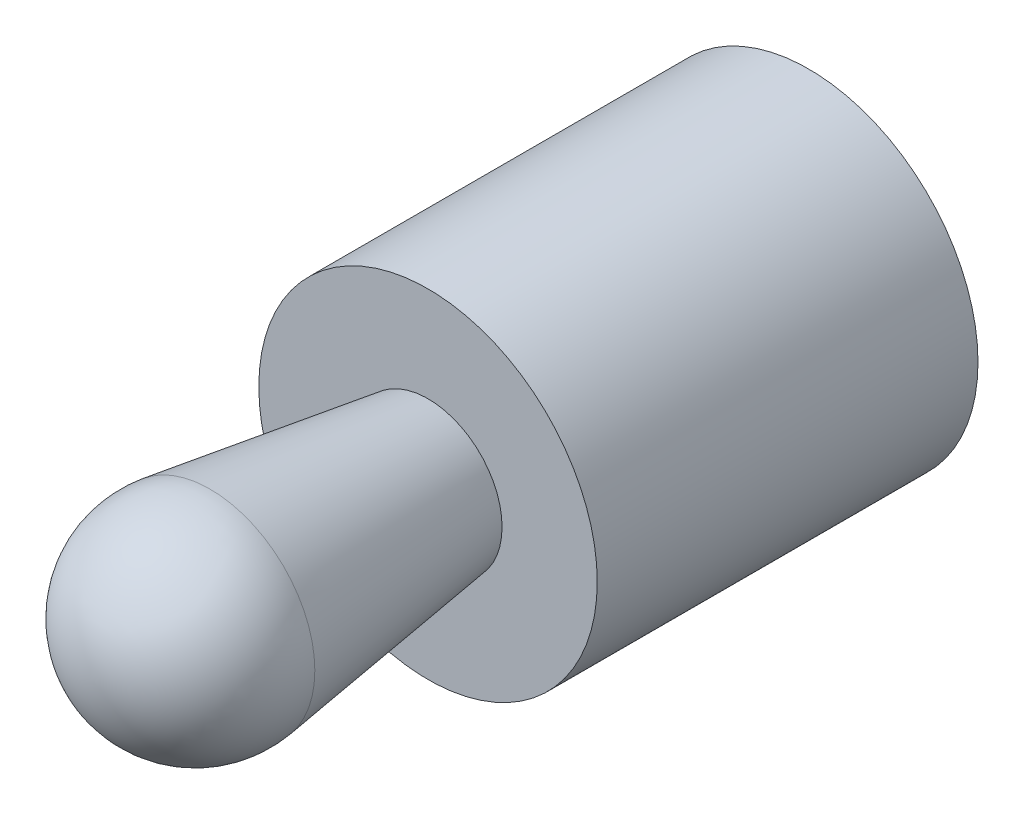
ISO-10303-21;
HEADER;
FILE_DESCRIPTION(('STEP AP214'),'2;1');
FILE_NAME('part.step','',(''),(''),'','','');
FILE_SCHEMA(('AUTOMOTIVE_DESIGN { 1 0 10303 214 1 1 1 1 }'));
ENDSEC;
DATA;
#1=APPLICATION_CONTEXT('core data for automotive mechanical design processes');
#2=APPLICATION_PROTOCOL_DEFINITION('international standard','automotive_design',2000,#1);
#3=PRODUCT_CONTEXT('',#1,'mechanical');
#4=PRODUCT('Part','Part','',(#3));
#5=PRODUCT_RELATED_PRODUCT_CATEGORY('part','',(#4));
#6=PRODUCT_DEFINITION_FORMATION('','',#4);
#7=PRODUCT_DEFINITION_CONTEXT('part definition',#1,'design');
#8=PRODUCT_DEFINITION('design','',#6,#7);
#9=PRODUCT_DEFINITION_SHAPE('','',#8);
#10=(LENGTH_UNIT() NAMED_UNIT(*) SI_UNIT(.MILLI.,.METRE.));
#11=(NAMED_UNIT(*) PLANE_ANGLE_UNIT() SI_UNIT($,.RADIAN.));
#12=(NAMED_UNIT(*) SI_UNIT($,.STERADIAN.) SOLID_ANGLE_UNIT());
#13=UNCERTAINTY_MEASURE_WITH_UNIT(LENGTH_MEASURE(1.E-05),#10,'distance_accuracy_value','');
#14=(GEOMETRIC_REPRESENTATION_CONTEXT(3) GLOBAL_UNCERTAINTY_ASSIGNED_CONTEXT((#13)) GLOBAL_UNIT_ASSIGNED_CONTEXT((#10,
#11,#12)) REPRESENTATION_CONTEXT('',''));
#15=CARTESIAN_POINT('',(0.,0.,0.));
#16=DIRECTION('',(0.,0.,1.));
#17=DIRECTION('',(1.,0.,0.));
#18=AXIS2_PLACEMENT_3D('',#15,#16,#17);
#19=CARTESIAN_POINT('',(0.,0.,0.));
#20=DIRECTION('',(0.,0.,1.));
#21=DIRECTION('',(1.,0.,0.));
#22=AXIS2_PLACEMENT_3D('',#19,#20,#21);
#23=PLANE('',#22);
#24=CARTESIAN_POINT('',(0.,0.,0.));
#25=DIRECTION('',(0.,0.,1.));
#26=DIRECTION('',(1.,0.,0.));
#27=AXIS2_PLACEMENT_3D('',#24,#25,#26);
#28=CIRCLE('',#27,8.);
#29=CARTESIAN_POINT('',(8.,0.,0.));
#30=VERTEX_POINT('',#29);
#31=EDGE_CURVE('E8',#30,#30,#28,.T.);
#32=ORIENTED_EDGE('',*,*,#31,.F.);
#33=EDGE_LOOP('',(#32));
#34=FACE_BOUND('',#33,.T.);
#35=ADVANCED_FACE('F12',(#34),#23,.F.);
#36=CARTESIAN_POINT('',(0.,0.,20.));
#37=DIRECTION('',(0.,0.,1.));
#38=DIRECTION('',(1.,0.,0.));
#39=AXIS2_PLACEMENT_3D('',#36,#37,#38);
#40=CYLINDRICAL_SURFACE('',#39,8.);
#41=CARTESIAN_POINT('',(0.,0.,18.));
#42=DIRECTION('',(0.,0.,1.));
#43=DIRECTION('',(1.,0.,0.));
#44=AXIS2_PLACEMENT_3D('',#41,#42,#43);
#45=CIRCLE('',#44,8.);
#46=CARTESIAN_POINT('',(8.,0.,18.));
#47=VERTEX_POINT('',#46);
#48=EDGE_CURVE('E18',#47,#47,#45,.T.);
#49=ORIENTED_EDGE('',*,*,#48,.F.);
#50=EDGE_LOOP('',(#49));
#51=FACE_BOUND('',#50,.T.);
#52=ORIENTED_EDGE('',*,*,#31,.T.);
#53=EDGE_LOOP('',(#52));
#54=FACE_BOUND('',#53,.T.);
#55=ADVANCED_FACE('F45',(#51,#54),#40,.T.);
#56=CARTESIAN_POINT('',(-3.5,0.,18.));
#57=DIRECTION('',(0.,0.,1.));
#58=DIRECTION('',(1.,0.,0.));
#59=AXIS2_PLACEMENT_3D('',#56,#57,#58);
#60=PLANE('',#59);
#61=ORIENTED_EDGE('',*,*,#48,.T.);
#62=EDGE_LOOP('',(#61));
#63=FACE_BOUND('',#62,.T.);
#64=CARTESIAN_POINT('',(0.,0.,18.));
#65=DIRECTION('',(0.,0.,1.));
#66=DIRECTION('',(1.,0.,0.));
#67=AXIS2_PLACEMENT_3D('',#64,#65,#66);
#68=CIRCLE('',#67,3.5);
#69=CARTESIAN_POINT('',(3.5,0.,18.));
#70=VERTEX_POINT('',#69);
#71=EDGE_CURVE('E22',#70,#70,#68,.T.);
#72=ORIENTED_EDGE('',*,*,#71,.F.);
#73=EDGE_LOOP('',(#72));
#74=FACE_BOUND('',#73,.T.);
#75=ADVANCED_FACE('F36',(#63,#74),#60,.T.);
#76=CARTESIAN_POINT('',(0.,0.,28.3026319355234));
#77=DIRECTION('',(0.,0.,1.));
#78=DIRECTION('',(1.,0.,0.));
#79=AXIS2_PLACEMENT_3D('',#76,#77,#78);
#80=CONICAL_SURFACE('',#79,4.95112894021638,0.139929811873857);
#81=ORIENTED_EDGE('',*,*,#71,.T.);
#82=EDGE_LOOP('',(#81));
#83=FACE_BOUND('',#82,.T.);
#84=CARTESIAN_POINT('',(0.,0.,28.3026319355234));
#85=DIRECTION('',(0.,0.,1.));
#86=DIRECTION('',(1.,0.,0.));
#87=AXIS2_PLACEMENT_3D('',#84,#85,#86);
#88=CIRCLE('',#87,4.95112894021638);
#89=CARTESIAN_POINT('',(4.95112894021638,0.,28.3026319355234));
#90=VERTEX_POINT('',#89);
#91=EDGE_CURVE('E26',#90,#90,#88,.T.);
#92=ORIENTED_EDGE('',*,*,#91,.F.);
#93=EDGE_LOOP('',(#92));
#94=FACE_BOUND('',#93,.T.);
#95=ADVANCED_FACE('F34',(#83,#94),#80,.T.);
#96=CARTESIAN_POINT('',(0.,0.,29.));
#97=DIRECTION('',(0.,0.,1.));
#98=DIRECTION('',(1.,0.,0.));
#99=AXIS2_PLACEMENT_3D('',#96,#97,#98);
#100=SPHERICAL_SURFACE('',#99,5.);
#101=ORIENTED_EDGE('',*,*,#91,.T.);
#102=EDGE_LOOP('',(#101));
#103=FACE_BOUND('',#102,.T.);
#104=ADVANCED_FACE('F32',(#103),#100,.T.);
#105=CLOSED_SHELL('',(#35,#55,#75,#95,#104));
#106=MANIFOLD_SOLID_BREP('B1',#105);
#107=ADVANCED_BREP_SHAPE_REPRESENTATION('',(#18,#106),#14);
#108=SHAPE_DEFINITION_REPRESENTATION(#9,#107);
ENDSEC;
END-ISO-10303-21;
